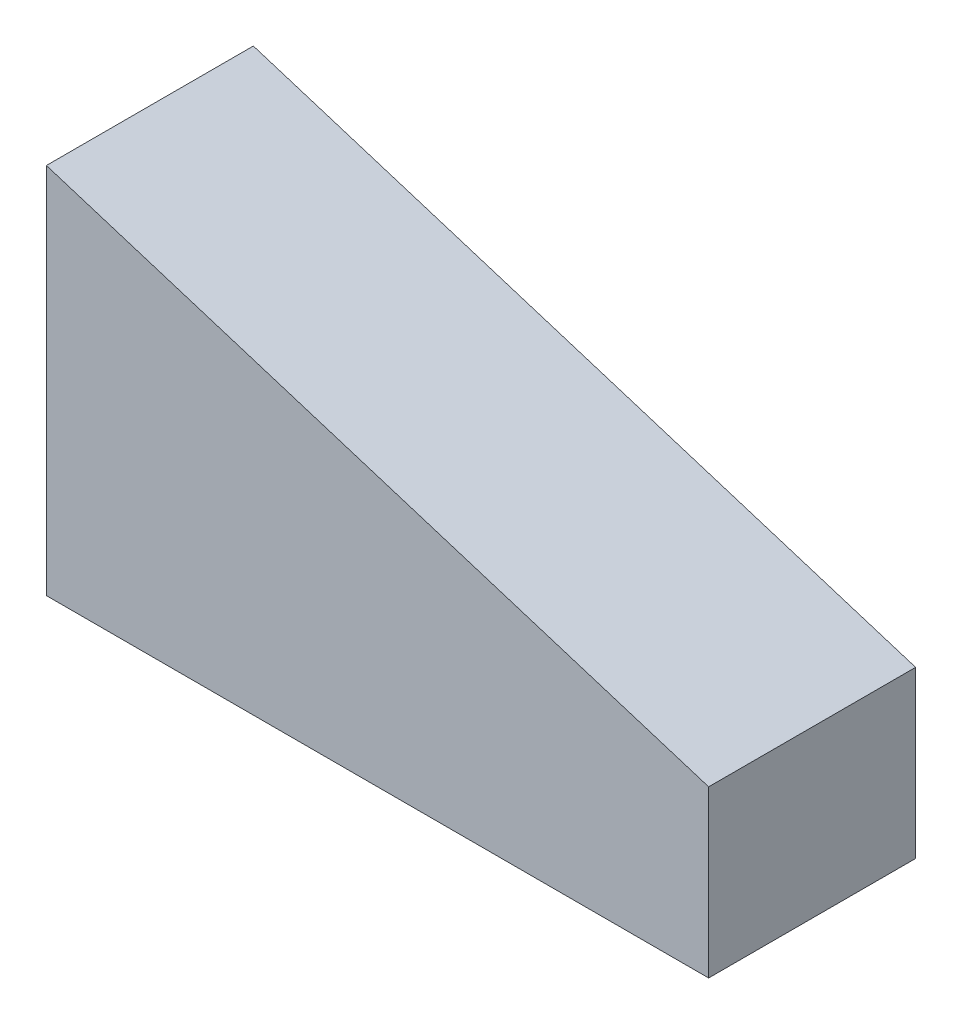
from build123d import *

# Parameters (mm, degrees)
BOSS_EXTRUDE1_DEPTH = 25


with BuildPart() as part:
    # Sketch1 → Boss-Extrude1 (new body)
    with BuildSketch(Plane.XY):
        Polygon((0, 0), (80, 0), (80, 20), (0, 45), align=None)
    extrude(amount=BOSS_EXTRUDE1_DEPTH)


solid = part.part
